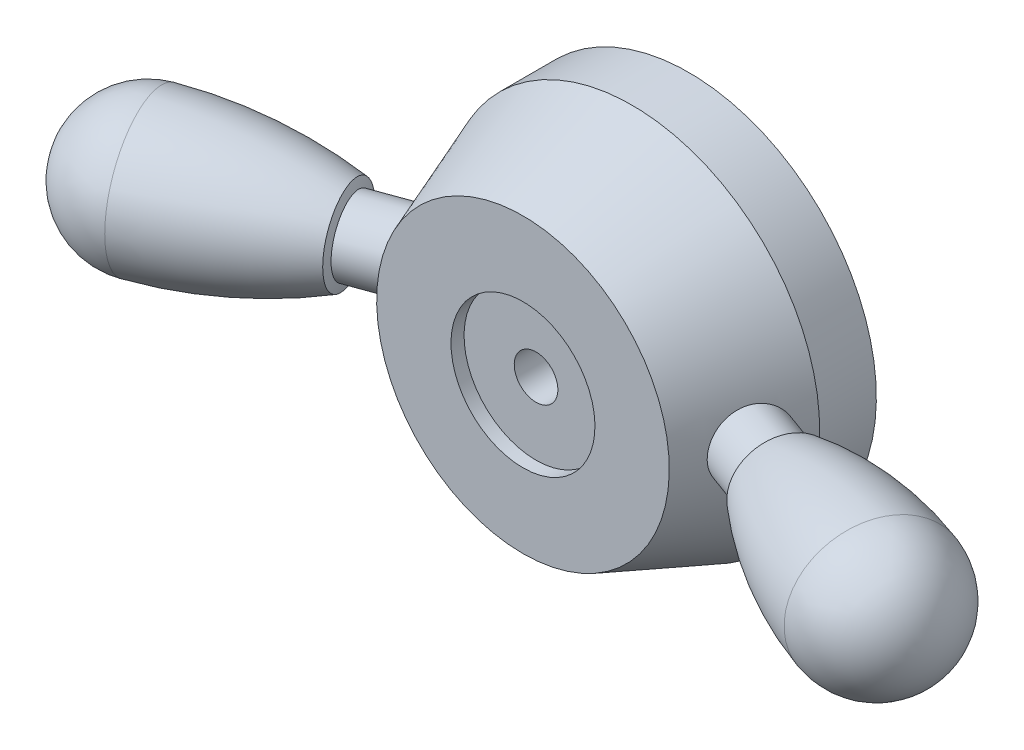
ISO-10303-21;
HEADER;
FILE_DESCRIPTION(('STEP AP214'),'2;1');
FILE_NAME('part.step','',(''),(''),'','','');
FILE_SCHEMA(('AUTOMOTIVE_DESIGN { 1 0 10303 214 1 1 1 1 }'));
ENDSEC;
DATA;
#1=APPLICATION_CONTEXT('core data for automotive mechanical design processes');
#2=APPLICATION_PROTOCOL_DEFINITION('international standard','automotive_design',2000,#1);
#3=PRODUCT_CONTEXT('',#1,'mechanical');
#4=PRODUCT('Part','Part','',(#3));
#5=PRODUCT_RELATED_PRODUCT_CATEGORY('part','',(#4));
#6=PRODUCT_DEFINITION_FORMATION('','',#4);
#7=PRODUCT_DEFINITION_CONTEXT('part definition',#1,'design');
#8=PRODUCT_DEFINITION('design','',#6,#7);
#9=PRODUCT_DEFINITION_SHAPE('','',#8);
#10=(LENGTH_UNIT() NAMED_UNIT(*) SI_UNIT(.MILLI.,.METRE.));
#11=(NAMED_UNIT(*) PLANE_ANGLE_UNIT() SI_UNIT($,.RADIAN.));
#12=(NAMED_UNIT(*) SI_UNIT($,.STERADIAN.) SOLID_ANGLE_UNIT());
#13=UNCERTAINTY_MEASURE_WITH_UNIT(LENGTH_MEASURE(1.E-05),#10,'distance_accuracy_value','');
#14=(GEOMETRIC_REPRESENTATION_CONTEXT(3) GLOBAL_UNCERTAINTY_ASSIGNED_CONTEXT((#13)) GLOBAL_UNIT_ASSIGNED_CONTEXT((#10,
#11,#12)) REPRESENTATION_CONTEXT('',''));
#15=CARTESIAN_POINT('',(0.,0.,0.));
#16=DIRECTION('',(0.,0.,1.));
#17=DIRECTION('',(1.,0.,0.));
#18=AXIS2_PLACEMENT_3D('',#15,#16,#17);
#19=CARTESIAN_POINT('',(0.,0.,16.));
#20=DIRECTION('',(0.,0.,-1.));
#21=DIRECTION('',(0.,1.,0.));
#22=AXIS2_PLACEMENT_3D('',#19,#20,#21);
#23=CONICAL_SURFACE('',#22,43.,0.361861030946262);
#24=CARTESIAN_POINT('',(40.6023738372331,5.23279611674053,21.44691602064));
#25=CARTESIAN_POINT('',(40.5305090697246,5.40328273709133,21.5776435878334));
#26=CARTESIAN_POINT('',(40.4557760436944,5.56746092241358,21.7149336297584));
#27=CARTESIAN_POINT('',(40.3014324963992,5.88221670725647,22.0019158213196));
#28=CARTESIAN_POINT('',(40.2218210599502,6.03279174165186,22.1516102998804));
#29=CARTESIAN_POINT('',(40.0586394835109,6.3193337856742,22.4625749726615));
#30=CARTESIAN_POINT('',(39.9750669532,6.45529180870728,22.6238521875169));
#31=CARTESIAN_POINT('',(39.8049492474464,6.71160161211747,22.9570119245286));
#32=CARTESIAN_POINT('',(39.7184029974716,6.8319476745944,23.1288982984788));
#33=CARTESIAN_POINT('',(39.5433858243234,7.05607794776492,23.4821308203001));
#34=CARTESIAN_POINT('',(39.4549155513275,7.15986765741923,23.6634738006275));
#35=CARTESIAN_POINT('',(39.2769702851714,7.3502160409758,24.0346440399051));
#36=CARTESIAN_POINT('',(39.1874948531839,7.43676685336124,24.2244751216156));
#37=CARTESIAN_POINT('',(39.0085765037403,7.59190145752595,24.6112963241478));
#38=CARTESIAN_POINT('',(38.9191335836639,7.6604896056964,24.8082846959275));
#39=CARTESIAN_POINT('',(38.7412453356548,7.77915688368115,25.2080805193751));
#40=CARTESIAN_POINT('',(38.6527995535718,7.82924479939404,25.4108851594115));
#41=CARTESIAN_POINT('',(38.4785291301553,7.91018748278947,25.8192218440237));
#42=CARTESIAN_POINT('',(38.392688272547,7.94120761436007,26.0247141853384));
#43=CARTESIAN_POINT('',(38.2236642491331,7.98443151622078,26.4386593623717));
#44=CARTESIAN_POINT('',(38.1404800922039,7.99664238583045,26.6471110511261));
#45=CARTESIAN_POINT('',(37.9774519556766,8.00215307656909,27.0655960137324));
#46=CARTESIAN_POINT('',(37.89760840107,7.99545049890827,27.275629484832));
#47=CARTESIAN_POINT('',(37.7419029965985,7.96316491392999,27.6957200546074));
#48=CARTESIAN_POINT('',(37.666041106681,7.93758209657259,27.9057771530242));
#49=CARTESIAN_POINT('',(37.5199753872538,7.86827649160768,28.3210665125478));
#50=CARTESIAN_POINT('',(37.4497014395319,7.82484472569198,28.5263227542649));
#51=CARTESIAN_POINT('',(37.3138756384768,7.72018168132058,28.933921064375));
#52=CARTESIAN_POINT('',(37.2483254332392,7.65894422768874,29.1362620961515));
#53=CARTESIAN_POINT('',(37.1222680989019,7.5191592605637,29.5363988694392));
#54=CARTESIAN_POINT('',(37.0617592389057,7.44061772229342,29.7341961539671));
#55=CARTESIAN_POINT('',(36.9458979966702,7.26676154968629,30.1239319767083));
#56=CARTESIAN_POINT('',(36.8905475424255,7.17144068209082,30.3158683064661));
#57=CARTESIAN_POINT('',(36.784889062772,6.96435381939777,30.6930854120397));
#58=CARTESIAN_POINT('',(36.7346004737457,6.8525282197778,30.8783389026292));
#59=CARTESIAN_POINT('',(36.639260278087,6.61348846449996,31.2400634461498));
#60=CARTESIAN_POINT('',(36.5942088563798,6.48627376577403,31.4165341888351));
#61=CARTESIAN_POINT('',(36.5092224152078,6.21733109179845,31.7593799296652));
#62=CARTESIAN_POINT('',(36.4692877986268,6.07560197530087,31.925754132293));
#63=CARTESIAN_POINT('',(36.3943547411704,5.77859927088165,32.2471372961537));
#64=CARTESIAN_POINT('',(36.359356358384,5.6233255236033,32.4021461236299));
#65=CARTESIAN_POINT('',(36.293510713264,5.29753011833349,32.7021313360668));
#66=CARTESIAN_POINT('',(36.2627437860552,5.12679477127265,32.8468933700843));
#67=CARTESIAN_POINT('',(36.2057988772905,4.77355453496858,33.1222610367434));
#68=CARTESIAN_POINT('',(36.1796208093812,4.59104986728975,33.2528669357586));
#69=CARTESIAN_POINT('',(36.1315549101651,4.21546720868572,33.498868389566));
#70=CARTESIAN_POINT('',(36.1096680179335,4.02238691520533,33.6142606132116));
#71=CARTESIAN_POINT('',(36.069907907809,3.62708694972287,33.8287699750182));
#72=CARTESIAN_POINT('',(36.0520331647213,3.42487078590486,33.9278932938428));
#73=CARTESIAN_POINT('',(36.0199761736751,3.01216479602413,34.1092440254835));
#74=CARTESIAN_POINT('',(36.0058023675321,2.80165729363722,34.1914327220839));
#75=CARTESIAN_POINT('',(35.9809596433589,2.37436878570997,34.3378470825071));
#76=CARTESIAN_POINT('',(35.9702894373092,2.15759011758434,34.4020793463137));
#77=CARTESIAN_POINT('',(35.9522438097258,1.71922940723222,34.5120154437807));
#78=CARTESIAN_POINT('',(35.9448686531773,1.49764698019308,34.5577177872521));
#79=CARTESIAN_POINT('',(35.93326484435,1.05132082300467,34.6301406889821));
#80=CARTESIAN_POINT('',(35.9290361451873,0.826577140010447,34.6568615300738));
#81=CARTESIAN_POINT('',(35.9236802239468,0.379327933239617,34.6907748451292));
#82=CARTESIAN_POINT('',(35.9225028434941,0.156846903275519,34.6982831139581));
#83=CARTESIAN_POINT('',(35.9230800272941,-0.288035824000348,34.6946133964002));
#84=CARTESIAN_POINT('',(35.9248356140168,-0.51043746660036,34.6834288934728));
#85=CARTESIAN_POINT('',(35.9313166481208,-0.953428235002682,34.6424737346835));
#86=CARTESIAN_POINT('',(35.9360414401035,-1.17401774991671,34.6127071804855));
#87=CARTESIAN_POINT('',(35.9485567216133,-1.61186002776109,34.5348754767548));
#88=CARTESIAN_POINT('',(35.9563472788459,-1.82911271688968,34.4868099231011));
#89=CARTESIAN_POINT('',(35.9750871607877,-2.25740818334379,34.3731852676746));
#90=CARTESIAN_POINT('',(35.9860166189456,-2.46848109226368,34.3077363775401));
#91=CARTESIAN_POINT('',(36.0112486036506,-2.88436401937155,34.1598025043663));
#92=CARTESIAN_POINT('',(36.0255511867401,-3.08917393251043,34.077317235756));
#93=CARTESIAN_POINT('',(36.0577610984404,-3.49112726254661,33.8960424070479));
#94=CARTESIAN_POINT('',(36.0756680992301,-3.68827137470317,33.7972543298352));
#95=CARTESIAN_POINT('',(36.1153540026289,-4.07366803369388,33.5841713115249));
#96=CARTESIAN_POINT('',(36.1371341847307,-4.26191761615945,33.4698712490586));
#97=CARTESIAN_POINT('',(36.1851832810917,-4.63088107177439,33.2249606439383));
#98=CARTESIAN_POINT('',(36.2115127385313,-4.81144597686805,33.0941375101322));
#99=CARTESIAN_POINT('',(36.2687217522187,-5.16087027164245,32.818591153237));
#100=CARTESIAN_POINT('',(36.299601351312,-5.32972955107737,32.6738677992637));
#101=CARTESIAN_POINT('',(36.3661885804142,-5.65464210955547,32.3716402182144));
#102=CARTESIAN_POINT('',(36.4018973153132,-5.81069244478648,32.2141330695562));
#103=CARTESIAN_POINT('',(36.4783617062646,-6.10883183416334,31.8876509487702));
#104=CARTESIAN_POINT('',(36.5191157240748,-6.25092539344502,31.7186797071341));
#105=CARTESIAN_POINT('',(36.606326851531,-6.52165576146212,31.3686719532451));
#106=CARTESIAN_POINT('',(36.6528399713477,-6.65013349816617,31.1875262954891));
#107=CARTESIAN_POINT('',(36.751338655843,-6.89094664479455,30.8162192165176));
#108=CARTESIAN_POINT('',(36.8033241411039,-7.00328228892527,30.6260579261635));
#109=CARTESIAN_POINT('',(36.9127950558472,-7.21097119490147,30.2382045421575));
#110=CARTESIAN_POINT('',(36.9702801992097,-7.30632533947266,30.0405128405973));
#111=CARTESIAN_POINT('',(37.0906755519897,-7.47932632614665,29.6391297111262));
#112=CARTESIAN_POINT('',(37.1535855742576,-7.55697377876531,29.4354384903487));
#113=CARTESIAN_POINT('',(37.2838853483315,-7.6931711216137,29.0259995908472));
#114=CARTESIAN_POINT('',(37.3512152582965,-7.7519303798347,28.8203025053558));
#115=CARTESIAN_POINT('',(37.4906590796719,-7.85108762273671,28.4062103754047));
#116=CARTESIAN_POINT('',(37.5627712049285,-7.89149241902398,28.1978163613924));
#117=CARTESIAN_POINT('',(37.7113858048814,-7.95366629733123,27.7797916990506));
#118=CARTESIAN_POINT('',(37.7878887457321,-7.97543339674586,27.5701609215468));
#119=CARTESIAN_POINT('',(37.9447389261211,-8.00016566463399,27.1512298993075));
#120=CARTESIAN_POINT('',(38.0250861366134,-8.00313097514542,26.9419296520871));
#121=CARTESIAN_POINT('',(38.1878297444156,-7.99034547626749,26.5280941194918));
#122=CARTESIAN_POINT('',(38.2701816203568,-7.9748564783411,26.3235331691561));
#123=CARTESIAN_POINT('',(38.4373180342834,-7.92572584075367,25.9175268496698));
#124=CARTESIAN_POINT('',(38.5221034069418,-7.89207790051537,25.7160825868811));
#125=CARTESIAN_POINT('',(38.693271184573,-7.80691312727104,25.3177825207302));
#126=CARTESIAN_POINT('',(38.7796530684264,-7.75540203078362,25.1209252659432));
#127=CARTESIAN_POINT('',(38.9532343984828,-7.63488739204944,24.7329237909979));
#128=CARTESIAN_POINT('',(39.0404341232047,-7.56587766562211,24.5417816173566));
#129=CARTESIAN_POINT('',(39.2153289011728,-7.41036796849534,24.16520336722));
#130=CARTESIAN_POINT('',(39.3030233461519,-7.32375360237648,23.9798142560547));
#131=CARTESIAN_POINT('',(39.4773989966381,-7.13395655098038,23.6172204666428));
#132=CARTESIAN_POINT('',(39.5640801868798,-7.03077361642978,23.440015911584));
#133=CARTESIAN_POINT('',(39.7355147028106,-6.80854008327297,23.094796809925));
#134=CARTESIAN_POINT('',(39.8202675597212,-6.68948567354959,22.9267844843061));
#135=CARTESIAN_POINT('',(39.986864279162,-6.43638351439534,22.601016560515));
#136=CARTESIAN_POINT('',(40.0687090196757,-6.30234034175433,22.4432578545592));
#137=CARTESIAN_POINT('',(40.2299836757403,-6.01768134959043,22.1362001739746));
#138=CARTESIAN_POINT('',(40.3093471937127,-5.86681865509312,21.9870951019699));
#139=CARTESIAN_POINT('',(40.463196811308,-5.5515071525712,21.7012509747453));
#140=CARTESIAN_POINT('',(40.5376829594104,-5.38705847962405,21.5645117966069));
#141=CARTESIAN_POINT('',(40.6808791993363,-5.04568143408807,21.304198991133));
#142=CARTESIAN_POINT('',(40.7495889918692,-4.86875241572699,21.1806260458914));
#143=CARTESIAN_POINT('',(40.8803734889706,-4.50363158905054,20.9473992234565));
#144=CARTESIAN_POINT('',(40.9424483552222,-4.31544005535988,20.8377450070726));
#145=CARTESIAN_POINT('',(41.0593554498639,-3.92848869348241,20.6327105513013));
#146=CARTESIAN_POINT('',(41.1141648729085,-3.7296982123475,20.5373751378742));
#147=CARTESIAN_POINT('',(41.2155806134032,-3.32354591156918,20.3620180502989));
#148=CARTESIAN_POINT('',(41.2621898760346,-3.11618720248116,20.2819908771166));
#149=CARTESIAN_POINT('',(41.3466097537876,-2.69428912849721,20.1377223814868));
#150=CARTESIAN_POINT('',(41.384419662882,-2.47974918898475,20.0734823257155));
#151=CARTESIAN_POINT('',(41.4507197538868,-2.04505827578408,19.9612261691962));
#152=CARTESIAN_POINT('',(41.4792100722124,-1.82490738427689,19.9132098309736));
#153=CARTESIAN_POINT('',(41.526130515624,-1.38386443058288,19.8343098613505));
#154=CARTESIAN_POINT('',(41.5447017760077,-1.16303037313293,19.8031857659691));
#155=CARTESIAN_POINT('',(41.5721596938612,-0.719077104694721,19.7572167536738));
#156=CARTESIAN_POINT('',(41.5810464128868,-0.495957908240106,19.7423717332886));
#157=CARTESIAN_POINT('',(41.5890135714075,-0.0490357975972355,19.7290613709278));
#158=CARTESIAN_POINT('',(41.588093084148,0.174767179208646,19.730597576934));
#159=CARTESIAN_POINT('',(41.5764563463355,0.621401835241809,19.7500427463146));
#160=CARTESIAN_POINT('',(41.5657402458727,0.844233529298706,19.7679514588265));
#161=CARTESIAN_POINT('',(41.5348329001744,1.28483986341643,19.8197290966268));
#162=CARTESIAN_POINT('',(41.5147485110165,1.50264318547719,19.8534180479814));
#163=CARTESIAN_POINT('',(41.4654135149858,1.93418205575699,19.9364630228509));
#164=CARTESIAN_POINT('',(41.4361629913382,2.14791764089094,19.9858189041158));
#165=CARTESIAN_POINT('',(41.3688997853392,2.56970129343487,20.0998449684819));
#166=CARTESIAN_POINT('',(41.3308929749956,2.77775306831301,20.1645048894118));
#167=CARTESIAN_POINT('',(41.2466138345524,3.18683299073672,20.3087205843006));
#168=CARTESIAN_POINT('',(41.2003428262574,3.38786225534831,20.3882739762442));
#169=CARTESIAN_POINT('',(41.074777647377,3.88106175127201,20.6056567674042));
#170=CARTESIAN_POINT('',(40.9906025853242,4.16802708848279,20.7526346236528));
#171=CARTESIAN_POINT('',(40.8071358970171,4.71879001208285,21.0773347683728));
#172=CARTESIAN_POINT('',(40.7078438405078,4.98258693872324,21.2550579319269));
#173=CARTESIAN_POINT('',(40.6023738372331,5.23279611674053,21.44691602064));
#174=B_SPLINE_CURVE_WITH_KNOTS('',3,(#24,#25,#26,#27,#28,#29,#30,#31,#32,#33,#34,#35,#36,#37,
#38,#39,#40,#41,#42,#43,#44,#45,#46,#47,#48,#49,#50,#51,#52,#53,#54,#55,#56,#57,#58,#59,#60,#61,
#62,#63,#64,#65,#66,#67,#68,#69,#70,#71,#72,#73,#74,#75,#76,#77,#78,#79,#80,#81,#82,#83,#84,#85,
#86,#87,#88,#89,#90,#91,#92,#93,#94,#95,#96,#97,#98,#99,#100,#101,#102,#103,#104,#105,#106,#107,
#108,#109,#110,#111,#112,#113,#114,#115,#116,#117,#118,#119,#120,#121,#122,#123,#124,#125,#126,
#127,#128,#129,#130,#131,#132,#133,#134,#135,#136,#137,#138,#139,#140,#141,#142,#143,#144,#145,
#146,#147,#148,#149,#150,#151,#152,#153,#154,#155,#156,#157,#158,#159,#160,#161,#162,#163,#164,
#165,#166,#167,#168,#169,#170,#171,#172,#173),.UNSPECIFIED.,.T.,.F.,(4,2,2,2,2,2,2,2,2,2,2,2,2,
2,2,2,2,2,2,2,2,2,2,2,2,2,2,2,2,2,2,2,2,2,2,2,2,2,2,2,2,2,2,2,2,2,2,2,2,2,2,2,2,2,2,2,2,2,2,2,2,
2,2,2,2,2,2,2,2,2,2,2,2,2,4),(0.,0.679330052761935,1.35878793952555,2.03866119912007,
2.718782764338,3.39867796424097,4.07888251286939,4.75892194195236,5.43863799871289,
6.11237288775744,6.7858534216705,7.45941937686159,8.13297855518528,8.79596576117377,
9.45918317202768,10.122171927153,10.7854074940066,11.4510996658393,12.1168153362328,
12.7825833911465,13.4483592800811,14.1254099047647,14.8024477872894,15.4796336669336,
16.1565616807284,16.8350205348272,17.5132296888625,18.1914933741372,18.8697469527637,
19.5367783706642,20.2040423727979,20.8711591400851,21.5382906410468,22.2012894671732,
22.8642994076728,23.5272490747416,24.1904181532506,24.8632093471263,25.5360068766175,
26.2089586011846,26.8816923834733,27.5615761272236,28.2414500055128,28.9212885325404,
29.6011036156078,30.2731002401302,30.9448472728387,31.6166657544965,32.2884791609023,
32.9508739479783,33.6134987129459,34.275910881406,34.9385574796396,35.6056561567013,
36.2727648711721,36.9400340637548,37.6071000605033,38.285722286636,38.9643377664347,
39.6429883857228,40.3216224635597,41.0023386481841,41.6828098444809,42.3633356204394,
43.043851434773,43.7144074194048,44.3849591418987,45.0555742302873,45.726179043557,
46.3893151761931,47.0524452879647,47.7151319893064,48.3777127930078,49.3746812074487,
50.3716780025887),.UNSPECIFIED.);
#175=CARTESIAN_POINT('',(40.6023738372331,5.23279611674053,21.44691602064));
#176=VERTEX_POINT('',#175);
#177=EDGE_CURVE('E24',#176,#176,#174,.T.);
#178=ORIENTED_EDGE('',*,*,#177,.F.);
#179=EDGE_LOOP('',(#178));
#180=FACE_BOUND('',#179,.T.);
#181=CARTESIAN_POINT('',(0.,0.,41.));
#182=DIRECTION('',(0.,0.,1.));
#183=DIRECTION('',(0.,-1.,0.));
#184=AXIS2_PLACEMENT_3D('',#181,#182,#183);
#185=CIRCLE('',#184,33.5367739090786);
#186=CARTESIAN_POINT('',(0.,-33.5367739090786,41.));
#187=VERTEX_POINT('',#186);
#188=EDGE_CURVE('E95',#187,#187,#185,.T.);
#189=ORIENTED_EDGE('',*,*,#188,.F.);
#190=EDGE_LOOP('',(#189));
#191=FACE_BOUND('',#190,.T.);
#192=CARTESIAN_POINT('',(0.,0.,16.));
#193=DIRECTION('',(0.,0.,1.));
#194=DIRECTION('',(0.,-1.,0.));
#195=AXIS2_PLACEMENT_3D('',#192,#193,#194);
#196=CIRCLE('',#195,43.);
#197=CARTESIAN_POINT('',(0.,-43.,16.));
#198=VERTEX_POINT('',#197);
#199=EDGE_CURVE('E98',#198,#198,#196,.T.);
#200=ORIENTED_EDGE('',*,*,#199,.T.);
#201=EDGE_LOOP('',(#200));
#202=FACE_BOUND('',#201,.T.);
#203=CARTESIAN_POINT('',(-40.602373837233,5.2327961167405,21.44691602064));
#204=CARTESIAN_POINT('',(-40.6735452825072,5.06396541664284,21.3174501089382));
#205=CARTESIAN_POINT('',(-40.7418704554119,4.88902599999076,21.1944808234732));
#206=CARTESIAN_POINT('',(-40.8720563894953,4.52797734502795,20.9621511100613));
#207=CARTESIAN_POINT('',(-40.9339161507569,4.34186638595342,20.8527927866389));
#208=CARTESIAN_POINT('',(-41.0503997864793,3.95969422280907,20.6483449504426));
#209=CARTESIAN_POINT('',(-41.1050204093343,3.76362860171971,20.5532618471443));
#210=CARTESIAN_POINT('',(-41.2063166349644,3.36288742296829,20.3779736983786));
#211=CARTESIAN_POINT('',(-41.2529894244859,3.15820884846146,20.2977739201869));
#212=CARTESIAN_POINT('',(-41.3377644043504,2.74168700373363,20.1527900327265));
#213=CARTESIAN_POINT('',(-41.3758647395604,2.52984219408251,20.0880092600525));
#214=CARTESIAN_POINT('',(-41.4429738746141,2.10052769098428,19.9743080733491));
#215=CARTESIAN_POINT('',(-41.471982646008,1.88305797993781,19.9253877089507));
#216=CARTESIAN_POINT('',(-41.5205095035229,1.44410525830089,19.8437433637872));
#217=CARTESIAN_POINT('',(-41.5400296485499,1.2226231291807,19.8110158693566));
#218=CARTESIAN_POINT('',(-41.5693206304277,0.777206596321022,19.7619634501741));
#219=CARTESIAN_POINT('',(-41.5790913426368,0.553272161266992,19.7456387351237));
#220=CARTESIAN_POINT('',(-41.5886914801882,0.107220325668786,19.729598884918));
#221=CARTESIAN_POINT('',(-41.5886357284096,-0.11488773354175,19.7296919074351));
#222=CARTESIAN_POINT('',(-41.5788683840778,-0.558374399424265,19.7460113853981));
#223=CARTESIAN_POINT('',(-41.5691534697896,-0.779752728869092,19.7622433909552));
#224=CARTESIAN_POINT('',(-41.5401994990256,-1.2200360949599,19.8107314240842));
#225=CARTESIAN_POINT('',(-41.5209638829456,-1.43894199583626,19.8429816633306));
#226=CARTESIAN_POINT('',(-41.4732192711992,-1.87288890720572,19.9233044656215));
#227=CARTESIAN_POINT('',(-41.4447067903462,-2.08792843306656,19.9713829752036));
#228=CARTESIAN_POINT('',(-41.3789066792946,-2.51178735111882,20.0828452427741));
#229=CARTESIAN_POINT('',(-41.3416507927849,-2.72062623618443,20.1461736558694));
#230=CARTESIAN_POINT('',(-41.2587734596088,-3.13154060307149,20.2878550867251));
#231=CARTESIAN_POINT('',(-41.2131482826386,-3.33361302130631,20.3662148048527));
#232=CARTESIAN_POINT('',(-41.1141206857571,-3.72954077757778,20.5374607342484));
#233=CARTESIAN_POINT('',(-41.0607178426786,-3.92339566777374,20.6303477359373));
#234=CARTESIAN_POINT('',(-40.9468259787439,-4.30150455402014,20.8300422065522));
#235=CARTESIAN_POINT('',(-40.8863400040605,-4.48576262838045,20.9368436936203));
#236=CARTESIAN_POINT('',(-40.758091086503,-4.84610689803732,21.1653883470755));
#237=CARTESIAN_POINT('',(-40.6902368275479,-5.02203946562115,21.2873225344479));
#238=CARTESIAN_POINT('',(-40.5488299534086,-5.36163772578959,21.5441316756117));
#239=CARTESIAN_POINT('',(-40.4752793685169,-5.52530774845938,21.679002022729));
#240=CARTESIAN_POINT('',(-40.3233030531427,-5.83942693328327,21.9609976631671));
#241=CARTESIAN_POINT('',(-40.2448752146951,-5.98987031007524,22.1081282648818));
#242=CARTESIAN_POINT('',(-40.084117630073,-6.27639632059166,22.413690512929));
#243=CARTESIAN_POINT('',(-40.0017892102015,-6.41248378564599,22.5721183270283));
#244=CARTESIAN_POINT('',(-39.8330731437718,-6.6710768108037,22.9014996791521));
#245=CARTESIAN_POINT('',(-39.7466470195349,-6.79338615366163,23.0725876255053));
#246=CARTESIAN_POINT('',(-39.5717279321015,-7.02150894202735,23.4244287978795));
#247=CARTESIAN_POINT('',(-39.4832349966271,-7.12732260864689,23.6051818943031));
#248=CARTESIAN_POINT('',(-39.3051765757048,-7.32167939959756,23.9752444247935));
#249=CARTESIAN_POINT('',(-39.2156110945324,-7.41022259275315,24.164553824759));
#250=CARTESIAN_POINT('',(-39.0363927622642,-7.56936366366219,24.5505260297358));
#251=CARTESIAN_POINT('',(-38.9467399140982,-7.63996212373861,24.7471885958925));
#252=CARTESIAN_POINT('',(-38.7688569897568,-7.76227612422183,25.1453343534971));
#253=CARTESIAN_POINT('',(-38.680621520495,-7.8141070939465,25.3467796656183));
#254=CARTESIAN_POINT('',(-38.5059268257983,-7.89906472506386,25.7542414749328));
#255=CARTESIAN_POINT('',(-38.4194669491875,-7.9321983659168,25.9602562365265));
#256=CARTESIAN_POINT('',(-38.2491100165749,-7.97951007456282,26.3755175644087));
#257=CARTESIAN_POINT('',(-38.1652131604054,-7.99368666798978,26.584764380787));
#258=CARTESIAN_POINT('',(-38.0007361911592,-8.00294484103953,27.0049762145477));
#259=CARTESIAN_POINT('',(-37.9201560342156,-7.99802667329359,27.215941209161));
#260=CARTESIAN_POINT('',(-37.7643330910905,-7.96937031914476,27.634356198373));
#261=CARTESIAN_POINT('',(-37.6890217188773,-7.94596193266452,27.8418033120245));
#262=CARTESIAN_POINT('',(-37.5427124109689,-7.88089033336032,28.2554347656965));
#263=CARTESIAN_POINT('',(-37.4717159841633,-7.83922077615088,28.4616186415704));
#264=CARTESIAN_POINT('',(-37.3344926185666,-7.73795818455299,28.8710589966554));
#265=CARTESIAN_POINT('',(-37.2682638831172,-7.67837194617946,29.0743165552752));
#266=CARTESIAN_POINT('',(-37.1408081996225,-7.5416946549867,29.476557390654));
#267=CARTESIAN_POINT('',(-37.0795831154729,-7.46459711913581,29.6755390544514));
#268=CARTESIAN_POINT('',(-36.9624908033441,-7.29371256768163,30.0671524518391));
#269=CARTESIAN_POINT('',(-36.9066097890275,-7.19997038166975,30.259799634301));
#270=CARTESIAN_POINT('',(-36.8000862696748,-6.99633755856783,30.637878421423));
#271=CARTESIAN_POINT('',(-36.7494439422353,-6.88644637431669,30.8233097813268));
#272=CARTESIAN_POINT('',(-36.6533675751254,-6.65128950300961,31.1855900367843));
#273=CARTESIAN_POINT('',(-36.6079338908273,-6.52602276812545,31.3624383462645));
#274=CARTESIAN_POINT('',(-36.5221678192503,-6.26098576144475,31.7062271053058));
#275=CARTESIAN_POINT('',(-36.4818355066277,-6.12121527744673,31.8731674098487));
#276=CARTESIAN_POINT('',(-36.4054905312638,-5.82576947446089,32.1984705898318));
#277=CARTESIAN_POINT('',(-36.3695572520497,-5.66987557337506,32.3566536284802));
#278=CARTESIAN_POINT('',(-36.3025392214,-5.3451604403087,32.6602573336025));
#279=CARTESIAN_POINT('',(-36.2714544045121,-5.17633938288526,32.8056781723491));
#280=CARTESIAN_POINT('',(-36.2138543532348,-4.82686669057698,33.0826312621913));
#281=CARTESIAN_POINT('',(-36.1873402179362,-4.64621222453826,33.2141601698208));
#282=CARTESIAN_POINT('',(-36.1386110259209,-4.2743929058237,33.462165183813));
#283=CARTESIAN_POINT('',(-36.116394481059,-4.083231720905,33.5786464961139));
#284=CARTESIAN_POINT('',(-36.075791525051,-3.68999742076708,33.796531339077));
#285=CARTESIAN_POINT('',(-36.0574386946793,-3.48784642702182,33.8978006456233));
#286=CARTESIAN_POINT('',(-36.0245197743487,-3.07552901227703,34.0831805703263));
#287=CARTESIAN_POINT('',(-36.0099536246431,-2.8653627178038,34.1672914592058));
#288=CARTESIAN_POINT('',(-35.9843581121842,-2.43851632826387,34.3175763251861));
#289=CARTESIAN_POINT('',(-35.9733285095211,-2.22183667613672,34.3837515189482));
#290=CARTESIAN_POINT('',(-35.9545967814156,-1.78352125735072,34.4975410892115));
#291=CARTESIAN_POINT('',(-35.9468945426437,-1.56188565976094,34.5451560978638));
#292=CARTESIAN_POINT('',(-35.9347427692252,-1.11826218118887,34.620855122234));
#293=CARTESIAN_POINT('',(-35.9302512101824,-0.896318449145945,34.6491912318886));
#294=CARTESIAN_POINT('',(-35.9242634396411,-0.450873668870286,34.687064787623));
#295=CARTESIAN_POINT('',(-35.9227661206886,-0.227373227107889,34.6966091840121));
#296=CARTESIAN_POINT('',(-35.9227318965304,0.219662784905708,34.6968268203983));
#297=CARTESIAN_POINT('',(-35.9241953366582,0.443198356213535,34.6874978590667));
#298=CARTESIAN_POINT('',(-35.930114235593,0.888649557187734,34.650055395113));
#299=CARTESIAN_POINT('',(-35.9345696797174,1.11056519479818,34.6219419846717));
#300=CARTESIAN_POINT('',(-35.9464930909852,1.54854426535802,34.5476487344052));
#301=CARTESIAN_POINT('',(-35.953924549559,1.7646459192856,34.5016880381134));
#302=CARTESIAN_POINT('',(-35.9719448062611,2.19226668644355,34.3921006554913));
#303=CARTESIAN_POINT('',(-35.9825347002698,2.40378418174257,34.3284678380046));
#304=CARTESIAN_POINT('',(-36.0070580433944,2.82064367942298,34.1841403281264));
#305=CARTESIAN_POINT('',(-36.0209905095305,3.02598747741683,34.1034506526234));
#306=CARTESIAN_POINT('',(-36.0524353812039,3.42925058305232,33.9256754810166));
#307=CARTESIAN_POINT('',(-36.0699490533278,3.62716723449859,33.8285841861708));
#308=CARTESIAN_POINT('',(-36.1090087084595,4.01615728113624,33.6177818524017));
#309=CARTESIAN_POINT('',(-36.1305939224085,4.20714051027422,33.5039116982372));
#310=CARTESIAN_POINT('',(-36.1779586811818,4.57883562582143,33.261255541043));
#311=CARTESIAN_POINT('',(-36.2037382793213,4.7595473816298,33.1324693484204));
#312=CARTESIAN_POINT('',(-36.2597815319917,5.10953937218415,32.8609949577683));
#313=CARTESIAN_POINT('',(-36.2900462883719,5.27881678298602,32.7183033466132));
#314=CARTESIAN_POINT('',(-36.3553134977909,5.60471113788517,32.4202217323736));
#315=CARTESIAN_POINT('',(-36.3903144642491,5.76133203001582,32.2648357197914));
#316=CARTESIAN_POINT('',(-36.4658589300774,6.06315521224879,31.9401228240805));
#317=CARTESIAN_POINT('',(-36.5064773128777,6.20815234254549,31.7706225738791));
#318=CARTESIAN_POINT('',(-36.5930432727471,6.48305525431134,31.4210752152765));
#319=CARTESIAN_POINT('',(-36.6389907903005,6.61296120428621,31.2410282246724));
#320=CARTESIAN_POINT('',(-36.7363418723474,6.85674364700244,30.8717905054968));
#321=CARTESIAN_POINT('',(-36.7877453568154,6.97062037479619,30.6825999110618));
#322=CARTESIAN_POINT('',(-36.8960464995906,7.18149777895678,30.2965467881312));
#323=CARTESIAN_POINT('',(-36.9529439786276,7.27849900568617,30.0996845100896));
#324=CARTESIAN_POINT('',(-37.0718171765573,7.45436896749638,29.7009919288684));
#325=CARTESIAN_POINT('',(-37.1337608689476,7.53334155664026,29.4991978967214));
#326=CARTESIAN_POINT('',(-37.2628152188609,7.67325124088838,29.0911495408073));
#327=CARTESIAN_POINT('',(-37.3299239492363,7.73419502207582,28.884896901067));
#328=CARTESIAN_POINT('',(-37.4690368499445,7.83761569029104,28.4694168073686));
#329=CARTESIAN_POINT('',(-37.5410413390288,7.8800913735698,28.2601891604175));
#330=CARTESIAN_POINT('',(-37.6895235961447,7.94624044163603,27.8403545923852));
#331=CARTESIAN_POINT('',(-37.7660013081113,7.96991406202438,27.6297476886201));
#332=CARTESIAN_POINT('',(-37.9215826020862,7.99804721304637,27.212242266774));
#333=CARTESIAN_POINT('',(-38.0006209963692,8.00282104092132,27.0053405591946));
#334=CARTESIAN_POINT('',(-38.1619186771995,7.99399969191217,26.5931126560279));
#335=CARTESIAN_POINT('',(-38.2441790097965,7.98039850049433,26.3877869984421));
#336=CARTESIAN_POINT('',(-38.411190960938,7.93494120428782,25.9801990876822));
#337=CARTESIAN_POINT('',(-38.4959425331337,7.90308543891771,25.7779367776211));
#338=CARTESIAN_POINT('',(-38.6671609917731,7.82138128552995,25.3778196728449));
#339=CARTESIAN_POINT('',(-38.7536279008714,7.77153265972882,25.1799649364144));
#340=CARTESIAN_POINT('',(-38.9275419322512,7.65416295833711,24.7897103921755));
#341=CARTESIAN_POINT('',(-39.0149900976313,7.58662094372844,24.5973173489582));
#342=CARTESIAN_POINT('',(-39.1898523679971,7.43442777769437,24.2194967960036));
#343=CARTESIAN_POINT('',(-39.2772664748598,7.34978216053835,24.0340670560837));
#344=CARTESIAN_POINT('',(-39.451146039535,7.1640145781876,23.6712964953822));
#345=CARTESIAN_POINT('',(-39.5376118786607,7.06289951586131,23.4939523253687));
#346=CARTESIAN_POINT('',(-39.7086841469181,6.84491701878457,23.1483599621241));
#347=CARTESIAN_POINT('',(-39.7932908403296,6.72805184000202,22.9801104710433));
#348=CARTESIAN_POINT('',(-40.006488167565,6.4094763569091,22.5619517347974));
#349=CARTESIAN_POINT('',(-40.1331267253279,6.19694746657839,22.319182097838));
#350=CARTESIAN_POINT('',(-40.376222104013,5.73871543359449,21.8614355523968));
#351=CARTESIAN_POINT('',(-40.4926786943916,5.49301154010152,21.6464592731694));
#352=CARTESIAN_POINT('',(-40.602373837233,5.2327961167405,21.44691602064));
#353=B_SPLINE_CURVE_WITH_KNOTS('',3,(#203,#204,#205,#206,#207,#208,#209,#210,#211,#212,#213,
#214,#215,#216,#217,#218,#219,#220,#221,#222,#223,#224,#225,#226,#227,#228,#229,#230,#231,#232,
#233,#234,#235,#236,#237,#238,#239,#240,#241,#242,#243,#244,#245,#246,#247,#248,#249,#250,#251,
#252,#253,#254,#255,#256,#257,#258,#259,#260,#261,#262,#263,#264,#265,#266,#267,#268,#269,#270,
#271,#272,#273,#274,#275,#276,#277,#278,#279,#280,#281,#282,#283,#284,#285,#286,#287,#288,#289,
#290,#291,#292,#293,#294,#295,#296,#297,#298,#299,#300,#301,#302,#303,#304,#305,#306,#307,#308,
#309,#310,#311,#312,#313,#314,#315,#316,#317,#318,#319,#320,#321,#322,#323,#324,#325,#326,#327,
#328,#329,#330,#331,#332,#333,#334,#335,#336,#337,#338,#339,#340,#341,#342,#343,#344,#345,#346,
#347,#348,#349,#350,#351,#352),.UNSPECIFIED.,.T.,.F.,(4,2,2,2,2,2,2,2,2,2,2,2,2,2,2,2,2,2,2,2,2,
2,2,2,2,2,2,2,2,2,2,2,2,2,2,2,2,2,2,2,2,2,2,2,2,2,2,2,2,2,2,2,2,2,2,2,2,2,2,2,2,2,2,2,2,2,2,2,2,
2,2,2,2,2,4),(0.,0.672743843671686,1.34559157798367,2.01874051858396,2.69212723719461,
3.36565954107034,4.03919395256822,4.71258215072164,5.38597895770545,6.05150760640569,
6.71726520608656,7.38278240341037,8.04854991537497,8.71193670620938,9.37561989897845,
10.0393392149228,10.7027741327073,11.3756512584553,12.0482896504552,12.7212208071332,
13.3939247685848,14.0752421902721,14.7565504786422,15.4378560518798,16.1191395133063,
16.7961585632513,17.4729247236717,18.1497435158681,18.8265533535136,19.4915566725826,
20.1567912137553,20.8217737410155,21.4870028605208,22.1504667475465,22.8139531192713,
23.4774847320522,24.1410260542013,24.8151774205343,25.489319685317,26.1636238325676,
26.8376940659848,27.5174008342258,28.1970968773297,28.876746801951,29.5563735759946,
30.2269332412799,30.8972448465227,31.5676346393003,32.2380211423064,32.9004238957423,
33.5630567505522,34.2254949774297,34.8881678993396,35.5575862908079,36.227013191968,
36.8966048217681,37.5659867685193,38.2453529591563,38.9247115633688,39.6040602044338,
40.2833866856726,40.9586951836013,41.6337529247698,42.3088546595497,42.9839479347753,
43.6477662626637,44.3118019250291,44.9758252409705,45.6398573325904,46.3046788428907,
46.9692855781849,47.6336144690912,48.2978483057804,49.3347116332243,50.3715984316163),.UNSPECIFIED.);
#354=CARTESIAN_POINT('',(-40.602373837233,5.2327961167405,21.44691602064));
#355=VERTEX_POINT('',#354);
#356=EDGE_CURVE('E8',#355,#355,#353,.T.);
#357=ORIENTED_EDGE('',*,*,#356,.F.);
#358=EDGE_LOOP('',(#357));
#359=FACE_BOUND('',#358,.T.);
#360=ADVANCED_FACE('F12',(#180,#191,#202,#359),#23,.T.);
#361=CARTESIAN_POINT('',(0.,0.,1.));
#362=DIRECTION('',(0.,0.,1.));
#363=DIRECTION('',(0.,-1.,0.));
#364=AXIS2_PLACEMENT_3D('',#361,#362,#363);
#365=CONICAL_SURFACE('',#364,17.5,0.785398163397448);
#366=CARTESIAN_POINT('',(0.,0.,0.));
#367=DIRECTION('',(0.,0.,1.));
#368=DIRECTION('',(0.,-1.,0.));
#369=AXIS2_PLACEMENT_3D('',#366,#367,#368);
#370=CIRCLE('',#369,16.5);
#371=CARTESIAN_POINT('',(0.,-16.5,0.));
#372=VERTEX_POINT('',#371);
#373=EDGE_CURVE('E28',#372,#372,#370,.T.);
#374=ORIENTED_EDGE('',*,*,#373,.T.);
#375=EDGE_LOOP('',(#374));
#376=FACE_BOUND('',#375,.T.);
#377=CARTESIAN_POINT('',(0.,0.,1.));
#378=DIRECTION('',(0.,0.,1.));
#379=DIRECTION('',(0.,-1.,0.));
#380=AXIS2_PLACEMENT_3D('',#377,#378,#379);
#381=CIRCLE('',#380,17.5);
#382=CARTESIAN_POINT('',(0.,-17.5,1.));
#383=VERTEX_POINT('',#382);
#384=EDGE_CURVE('E267',#383,#383,#381,.T.);
#385=ORIENTED_EDGE('',*,*,#384,.F.);
#386=EDGE_LOOP('',(#385));
#387=FACE_BOUND('',#386,.T.);
#388=ADVANCED_FACE('F14',(#376,#387),#365,.T.);
#389=CARTESIAN_POINT('',(16.5,0.,0.));
#390=DIRECTION('',(0.,0.,-1.));
#391=DIRECTION('',(0.,1.,0.));
#392=AXIS2_PLACEMENT_3D('',#389,#390,#391);
#393=PLANE('',#392);
#394=CARTESIAN_POINT('',(0.,0.,0.));
#395=DIRECTION('',(0.,0.,1.));
#396=DIRECTION('',(0.,-1.,0.));
#397=AXIS2_PLACEMENT_3D('',#394,#395,#396);
#398=CIRCLE('',#397,5.);
#399=CARTESIAN_POINT('',(0.,-5.,0.));
#400=VERTEX_POINT('',#399);
#401=EDGE_CURVE('E32',#400,#400,#398,.T.);
#402=ORIENTED_EDGE('',*,*,#401,.T.);
#403=EDGE_LOOP('',(#402));
#404=FACE_BOUND('',#403,.T.);
#405=ORIENTED_EDGE('',*,*,#373,.F.);
#406=EDGE_LOOP('',(#405));
#407=FACE_BOUND('',#406,.T.);
#408=ADVANCED_FACE('F89',(#404,#407),#393,.T.);
#409=CARTESIAN_POINT('',(0.,0.,67.6284115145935));
#410=DIRECTION('',(0.,0.,1.));
#411=DIRECTION('',(0.,-1.,0.));
#412=AXIS2_PLACEMENT_3D('',#409,#410,#411);
#413=CYLINDRICAL_SURFACE('',#412,5.);
#414=ORIENTED_EDGE('',*,*,#401,.F.);
#415=EDGE_LOOP('',(#414));
#416=FACE_BOUND('',#415,.T.);
#417=CARTESIAN_POINT('',(0.,0.,38.));
#418=DIRECTION('',(0.,0.,1.));
#419=DIRECTION('',(0.,-1.,0.));
#420=AXIS2_PLACEMENT_3D('',#417,#418,#419);
#421=CIRCLE('',#420,5.);
#422=CARTESIAN_POINT('',(0.,-5.,38.));
#423=VERTEX_POINT('',#422);
#424=EDGE_CURVE('E113',#423,#423,#421,.T.);
#425=ORIENTED_EDGE('',*,*,#424,.T.);
#426=EDGE_LOOP('',(#425));
#427=FACE_BOUND('',#426,.T.);
#428=ADVANCED_FACE('F120',(#416,#427),#413,.F.);
#429=CARTESIAN_POINT('',(16.5,0.,38.));
#430=DIRECTION('',(0.,0.,-1.));
#431=DIRECTION('',(0.,1.,0.));
#432=AXIS2_PLACEMENT_3D('',#429,#430,#431);
#433=PLANE('',#432);
#434=ORIENTED_EDGE('',*,*,#424,.F.);
#435=EDGE_LOOP('',(#434));
#436=FACE_BOUND('',#435,.T.);
#437=CARTESIAN_POINT('',(0.,0.,38.));
#438=DIRECTION('',(0.,0.,1.));
#439=DIRECTION('',(0.,-1.,0.));
#440=AXIS2_PLACEMENT_3D('',#437,#438,#439);
#441=CIRCLE('',#440,16.5);
#442=CARTESIAN_POINT('',(0.,-16.5,38.));
#443=VERTEX_POINT('',#442);
#444=EDGE_CURVE('E110',#443,#443,#441,.T.);
#445=ORIENTED_EDGE('',*,*,#444,.T.);
#446=EDGE_LOOP('',(#445));
#447=FACE_BOUND('',#446,.T.);
#448=ADVANCED_FACE('F123',(#436,#447),#433,.F.);
#449=CARTESIAN_POINT('',(0.,0.,67.6284115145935));
#450=DIRECTION('',(0.,0.,1.));
#451=DIRECTION('',(0.,-1.,0.));
#452=AXIS2_PLACEMENT_3D('',#449,#450,#451);
#453=CYLINDRICAL_SURFACE('',#452,16.5);
#454=CARTESIAN_POINT('',(0.,0.,41.));
#455=DIRECTION('',(0.,0.,1.));
#456=DIRECTION('',(0.,-1.,0.));
#457=AXIS2_PLACEMENT_3D('',#454,#455,#456);
#458=CIRCLE('',#457,16.5);
#459=CARTESIAN_POINT('',(0.,-16.5,41.));
#460=VERTEX_POINT('',#459);
#461=EDGE_CURVE('E101',#460,#460,#458,.T.);
#462=ORIENTED_EDGE('',*,*,#461,.T.);
#463=EDGE_LOOP('',(#462));
#464=FACE_BOUND('',#463,.T.);
#465=ORIENTED_EDGE('',*,*,#444,.F.);
#466=EDGE_LOOP('',(#465));
#467=FACE_BOUND('',#466,.T.);
#468=ADVANCED_FACE('F79',(#464,#467),#453,.F.);
#469=CARTESIAN_POINT('',(33.5367739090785,0.,41.));
#470=DIRECTION('',(0.,0.,-1.));
#471=DIRECTION('',(0.,1.,0.));
#472=AXIS2_PLACEMENT_3D('',#469,#470,#471);
#473=PLANE('',#472);
#474=ORIENTED_EDGE('',*,*,#461,.F.);
#475=EDGE_LOOP('',(#474));
#476=FACE_BOUND('',#475,.T.);
#477=ORIENTED_EDGE('',*,*,#188,.T.);
#478=EDGE_LOOP('',(#477));
#479=FACE_BOUND('',#478,.T.);
#480=ADVANCED_FACE('F72',(#476,#479),#473,.F.);
#481=CARTESIAN_POINT('',(0.,0.,67.6284115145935));
#482=DIRECTION('',(0.,0.,1.));
#483=DIRECTION('',(0.,-1.,0.));
#484=AXIS2_PLACEMENT_3D('',#481,#482,#483);
#485=CYLINDRICAL_SURFACE('',#484,43.);
#486=ORIENTED_EDGE('',*,*,#199,.F.);
#487=EDGE_LOOP('',(#486));
#488=FACE_BOUND('',#487,.T.);
#489=CARTESIAN_POINT('',(0.,0.,3.));
#490=DIRECTION('',(0.,0.,1.));
#491=DIRECTION('',(0.,-1.,0.));
#492=AXIS2_PLACEMENT_3D('',#489,#490,#491);
#493=CIRCLE('',#492,43.);
#494=CARTESIAN_POINT('',(0.,-43.,3.));
#495=VERTEX_POINT('',#494);
#496=EDGE_CURVE('E99',#495,#495,#493,.T.);
#497=ORIENTED_EDGE('',*,*,#496,.T.);
#498=EDGE_LOOP('',(#497));
#499=FACE_BOUND('',#498,.T.);
#500=ADVANCED_FACE('F69',(#488,#499),#485,.T.);
#501=CARTESIAN_POINT('',(43.,0.,3.));
#502=DIRECTION('',(0.,0.,-1.));
#503=DIRECTION('',(0.,1.,0.));
#504=AXIS2_PLACEMENT_3D('',#501,#502,#503);
#505=PLANE('',#504);
#506=CARTESIAN_POINT('',(0.,0.,3.));
#507=DIRECTION('',(0.,0.,1.));
#508=DIRECTION('',(0.,-1.,0.));
#509=AXIS2_PLACEMENT_3D('',#506,#507,#508);
#510=CIRCLE('',#509,17.5);
#511=CARTESIAN_POINT('',(0.,-17.5,3.));
#512=VERTEX_POINT('',#511);
#513=EDGE_CURVE('E104',#512,#512,#510,.T.);
#514=ORIENTED_EDGE('',*,*,#513,.T.);
#515=EDGE_LOOP('',(#514));
#516=FACE_BOUND('',#515,.T.);
#517=ORIENTED_EDGE('',*,*,#496,.F.);
#518=EDGE_LOOP('',(#517));
#519=FACE_BOUND('',#518,.T.);
#520=ADVANCED_FACE('F66',(#516,#519),#505,.T.);
#521=CARTESIAN_POINT('',(0.,0.,67.6284115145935));
#522=DIRECTION('',(0.,0.,1.));
#523=DIRECTION('',(0.,-1.,0.));
#524=AXIS2_PLACEMENT_3D('',#521,#522,#523);
#525=CYLINDRICAL_SURFACE('',#524,17.5);
#526=ORIENTED_EDGE('',*,*,#513,.F.);
#527=EDGE_LOOP('',(#526));
#528=FACE_BOUND('',#527,.T.);
#529=ORIENTED_EDGE('',*,*,#384,.T.);
#530=EDGE_LOOP('',(#529));
#531=FACE_BOUND('',#530,.T.);
#532=ADVANCED_FACE('F48',(#528,#531),#525,.T.);
#533=CARTESIAN_POINT('',(32.8957668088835,0.,25.0815653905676));
#534=DIRECTION('',(-0.939692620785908,0.,-0.342020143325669));
#535=DIRECTION('',(0.342020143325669,0.,-0.939692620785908));
#536=AXIS2_PLACEMENT_3D('',#533,#534,#535);
#537=CYLINDRICAL_SURFACE('',#536,8.);
#538=CARTESIAN_POINT('',(49.1865402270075,0.,31.01092200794));
#539=DIRECTION('',(-0.939692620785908,0.,-0.342020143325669));
#540=DIRECTION('',(0.342020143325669,0.,-0.939692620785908));
#541=AXIS2_PLACEMENT_3D('',#538,#539,#540);
#542=CIRCLE('',#541,8.);
#543=CARTESIAN_POINT('',(51.9227013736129,0.,23.4933810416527));
#544=VERTEX_POINT('',#543);
#545=EDGE_CURVE('E254',#544,#544,#542,.T.);
#546=ORIENTED_EDGE('',*,*,#545,.T.);
#547=EDGE_LOOP('',(#546));
#548=FACE_BOUND('',#547,.T.);
#549=ORIENTED_EDGE('',*,*,#177,.T.);
#550=EDGE_LOOP('',(#549));
#551=FACE_BOUND('',#550,.T.);
#552=ADVANCED_FACE('F42',(#548,#551),#537,.T.);
#553=CARTESIAN_POINT('',(83.5,0.,43.5));
#554=DIRECTION('',(0.,-1.,0.));
#555=DIRECTION('',(1.,0.,0.));
#556=AXIS2_PLACEMENT_3D('',#553,#554,#555);
#557=SPHERICAL_SURFACE('',#556,16.5);
#558=CARTESIAN_POINT('',(83.5,0.,43.5));
#559=DIRECTION('',(-0.939692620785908,0.,-0.342020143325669));
#560=DIRECTION('',(0.342020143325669,0.,-0.939692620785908));
#561=AXIS2_PLACEMENT_3D('',#558,#559,#560);
#562=SPHERICAL_SURFACE('',#561,16.5);
#563=CARTESIAN_POINT('',(83.500000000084,0.,43.5000000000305));
#564=DIRECTION('',(-0.939692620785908,0.,-0.342020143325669));
#565=DIRECTION('',(0.342020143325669,0.,-0.939692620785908));
#566=AXIS2_PLACEMENT_3D('',#563,#564,#565);
#567=CIRCLE('',#566,16.5);
#568=CARTESIAN_POINT('',(89.1433323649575,0.,27.995071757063));
#569=VERTEX_POINT('',#568);
#570=EDGE_CURVE('E264',#569,#569,#567,.T.);
#571=ORIENTED_EDGE('',*,*,#570,.F.);
#572=EDGE_LOOP('',(#571));
#573=FACE_BOUND('',#572,.T.);
#574=ADVANCED_FACE('F47',(#573),#562,.T.);
#575=CARTESIAN_POINT('',(83.133448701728,0.,43.3665862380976));
#576=DIRECTION('',(-0.939692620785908,0.,-0.342020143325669));
#577=DIRECTION('',(0.342020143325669,0.,-0.939692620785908));
#578=AXIS2_PLACEMENT_3D('',#575,#576,#577);
#579=DEGENERATE_TOROIDAL_SURFACE('',#578,83.9992429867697,100.5,.F.);
#580=CARTESIAN_POINT('',(49.7195816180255,0.,31.2049332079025));
#581=DIRECTION('',(-0.939692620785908,0.,-0.342020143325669));
#582=DIRECTION('',(0.342020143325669,0.,-0.939692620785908));
#583=AXIS2_PLACEMENT_3D('',#580,#581,#582);
#584=CIRCLE('',#583,9.99999999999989);
#585=CARTESIAN_POINT('',(53.1397830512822,0.,21.8080070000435));
#586=VERTEX_POINT('',#585);
#587=EDGE_CURVE('E261',#586,#586,#584,.T.);
#588=ORIENTED_EDGE('',*,*,#587,.F.);
#589=EDGE_LOOP('',(#588));
#590=FACE_BOUND('',#589,.T.);
#591=ORIENTED_EDGE('',*,*,#570,.T.);
#592=EDGE_LOOP('',(#591));
#593=FACE_BOUND('',#592,.T.);
#594=ADVANCED_FACE('F56',(#590,#593),#579,.F.);
#595=CARTESIAN_POINT('',(79.2713832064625,0.,41.960909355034));
#596=DIRECTION('',(0.,-1.,0.));
#597=DIRECTION('',(1.,0.,0.));
#598=AXIS2_PLACEMENT_3D('',#595,#596,#597);
#599=SPHERICAL_SURFACE('',#598,33.);
#600=CARTESIAN_POINT('',(79.2713832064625,0.,41.960909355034));
#601=DIRECTION('',(-0.939692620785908,0.,-0.342020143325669));
#602=DIRECTION('',(0.342020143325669,0.,-0.939692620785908));
#603=AXIS2_PLACEMENT_3D('',#600,#601,#602);
#604=SPHERICAL_SURFACE('',#603,33.);
#605=ORIENTED_EDGE('',*,*,#545,.F.);
#606=EDGE_LOOP('',(#605));
#607=FACE_BOUND('',#606,.T.);
#608=ORIENTED_EDGE('',*,*,#587,.T.);
#609=EDGE_LOOP('',(#608));
#610=FACE_BOUND('',#609,.T.);
#611=ADVANCED_FACE('F52',(#607,#610),#604,.T.);
#612=CARTESIAN_POINT('',(-31.941028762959,0.,24.7340691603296));
#613=DIRECTION('',(0.939692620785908,0.,-0.342020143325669));
#614=DIRECTION('',(0.342020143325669,0.,0.939692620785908));
#615=AXIS2_PLACEMENT_3D('',#612,#613,#614);
#616=CYLINDRICAL_SURFACE('',#615,8.);
#617=CARTESIAN_POINT('',(-49.1865402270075,0.,31.01092200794));
#618=DIRECTION('',(0.939692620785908,0.,-0.342020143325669));
#619=DIRECTION('',(0.342020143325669,0.,0.939692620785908));
#620=AXIS2_PLACEMENT_3D('',#617,#618,#619);
#621=CIRCLE('',#620,8.);
#622=CARTESIAN_POINT('',(-46.4503790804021,0.,38.5284629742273));
#623=VERTEX_POINT('',#622);
#624=EDGE_CURVE('E251',#623,#623,#621,.T.);
#625=ORIENTED_EDGE('',*,*,#624,.T.);
#626=EDGE_LOOP('',(#625));
#627=FACE_BOUND('',#626,.T.);
#628=ORIENTED_EDGE('',*,*,#356,.T.);
#629=EDGE_LOOP('',(#628));
#630=FACE_BOUND('',#629,.T.);
#631=ADVANCED_FACE('F55',(#627,#630),#616,.T.);
#632=CARTESIAN_POINT('',(-79.271383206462,0.,41.960909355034));
#633=DIRECTION('',(0.,-1.,0.));
#634=DIRECTION('',(1.,0.,0.));
#635=AXIS2_PLACEMENT_3D('',#632,#633,#634);
#636=SPHERICAL_SURFACE('',#635,33.);
#637=CARTESIAN_POINT('',(-79.271383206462,0.,41.960909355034));
#638=DIRECTION('',(0.939692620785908,0.,-0.342020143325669));
#639=DIRECTION('',(0.342020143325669,0.,0.939692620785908));
#640=AXIS2_PLACEMENT_3D('',#637,#638,#639);
#641=SPHERICAL_SURFACE('',#640,33.);
#642=CARTESIAN_POINT('',(-49.7195816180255,0.,31.2049332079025));
#643=DIRECTION('',(0.939692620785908,0.,-0.342020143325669));
#644=DIRECTION('',(0.342020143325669,0.,0.939692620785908));
#645=AXIS2_PLACEMENT_3D('',#642,#643,#644);
#646=CIRCLE('',#645,10.);
#647=CARTESIAN_POINT('',(-46.2993801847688,0.,40.6018594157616));
#648=VERTEX_POINT('',#647);
#649=EDGE_CURVE('E250',#648,#648,#646,.T.);
#650=ORIENTED_EDGE('',*,*,#649,.T.);
#651=EDGE_LOOP('',(#650));
#652=FACE_BOUND('',#651,.T.);
#653=ORIENTED_EDGE('',*,*,#624,.F.);
#654=EDGE_LOOP('',(#653));
#655=FACE_BOUND('',#654,.T.);
#656=ADVANCED_FACE('F50',(#652,#655),#641,.T.);
#657=CARTESIAN_POINT('',(-83.1334487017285,0.,43.3665862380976));
#658=DIRECTION('',(0.939692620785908,0.,-0.342020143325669));
#659=DIRECTION('',(0.342020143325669,0.,0.939692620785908));
#660=AXIS2_PLACEMENT_3D('',#657,#658,#659);
#661=DEGENERATE_TOROIDAL_SURFACE('',#660,83.9992429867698,100.5,.F.);
#662=CARTESIAN_POINT('',(-83.5,0.,43.5));
#663=DIRECTION('',(0.939692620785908,0.,-0.342020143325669));
#664=DIRECTION('',(0.342020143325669,0.,0.939692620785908));
#665=AXIS2_PLACEMENT_3D('',#662,#663,#664);
#666=CIRCLE('',#665,16.5000000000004);
#667=CARTESIAN_POINT('',(-77.8566676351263,0.,59.0049282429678));
#668=VERTEX_POINT('',#667);
#669=EDGE_CURVE('E249',#668,#668,#666,.T.);
#670=ORIENTED_EDGE('',*,*,#669,.T.);
#671=EDGE_LOOP('',(#670));
#672=FACE_BOUND('',#671,.T.);
#673=ORIENTED_EDGE('',*,*,#649,.F.);
#674=EDGE_LOOP('',(#673));
#675=FACE_BOUND('',#674,.T.);
#676=ADVANCED_FACE('F210',(#672,#675),#661,.F.);
#677=CARTESIAN_POINT('',(-83.5,0.,43.5));
#678=DIRECTION('',(0.,-1.,0.));
#679=DIRECTION('',(1.,0.,0.));
#680=AXIS2_PLACEMENT_3D('',#677,#678,#679);
#681=SPHERICAL_SURFACE('',#680,16.5000000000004);
#682=CARTESIAN_POINT('',(-83.5,0.,43.5));
#683=DIRECTION('',(0.939692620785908,0.,-0.342020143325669));
#684=DIRECTION('',(0.342020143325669,0.,0.939692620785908));
#685=AXIS2_PLACEMENT_3D('',#682,#683,#684);
#686=SPHERICAL_SURFACE('',#685,16.5000000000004);
#687=ORIENTED_EDGE('',*,*,#669,.F.);
#688=EDGE_LOOP('',(#687));
#689=FACE_BOUND('',#688,.T.);
#690=ADVANCED_FACE('F217',(#689),#686,.T.);
#691=CLOSED_SHELL('',(#360,#388,#408,#428,#448,#468,#480,#500,#520,#532,#552,#574,#594,#611,
#631,#656,#676,#690));
#692=MANIFOLD_SOLID_BREP('B1',#691);
#693=ADVANCED_BREP_SHAPE_REPRESENTATION('',(#18,#692),#14);
#694=SHAPE_DEFINITION_REPRESENTATION(#9,#693);
ENDSEC;
END-ISO-10303-21;
